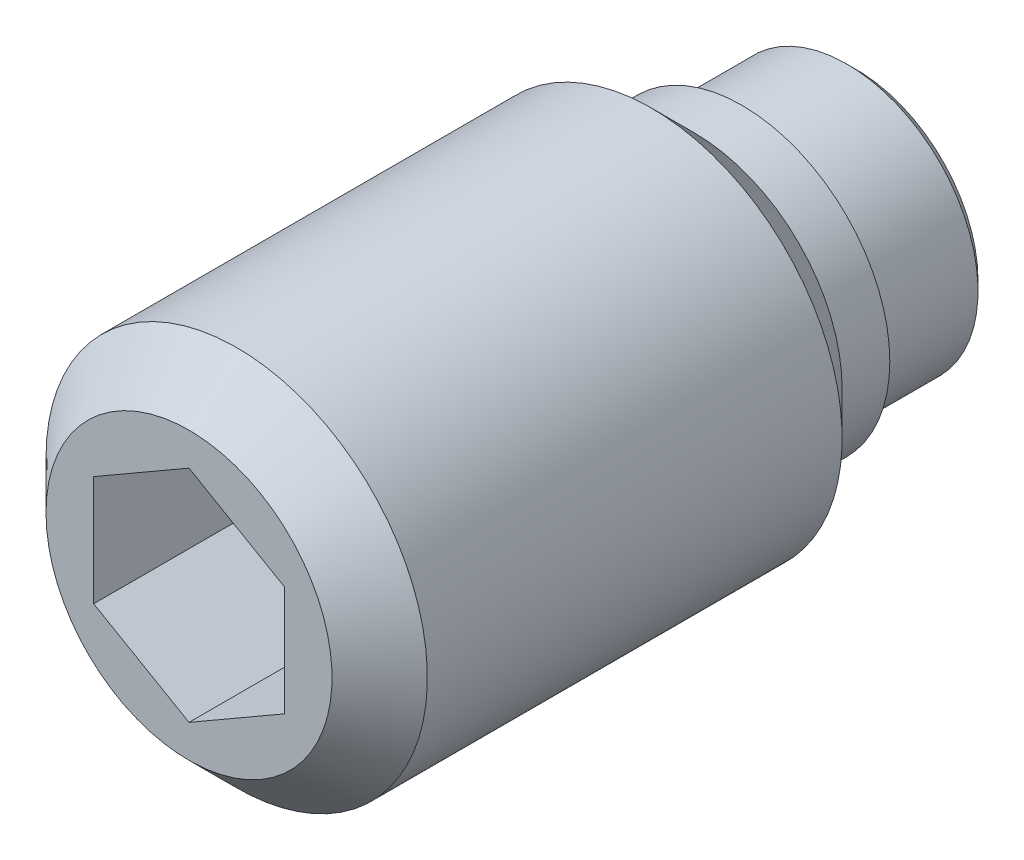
ISO-10303-21;
HEADER;
FILE_DESCRIPTION(('STEP AP214'),'2;1');
FILE_NAME('part.step','',(''),(''),'','','');
FILE_SCHEMA(('AUTOMOTIVE_DESIGN { 1 0 10303 214 1 1 1 1 }'));
ENDSEC;
DATA;
#1=APPLICATION_CONTEXT('core data for automotive mechanical design processes');
#2=APPLICATION_PROTOCOL_DEFINITION('international standard','automotive_design',2000,#1);
#3=PRODUCT_CONTEXT('',#1,'mechanical');
#4=PRODUCT('Part','Part','',(#3));
#5=PRODUCT_RELATED_PRODUCT_CATEGORY('part','',(#4));
#6=PRODUCT_DEFINITION_FORMATION('','',#4);
#7=PRODUCT_DEFINITION_CONTEXT('part definition',#1,'design');
#8=PRODUCT_DEFINITION('design','',#6,#7);
#9=PRODUCT_DEFINITION_SHAPE('','',#8);
#10=(LENGTH_UNIT() NAMED_UNIT(*) SI_UNIT(.MILLI.,.METRE.));
#11=(NAMED_UNIT(*) PLANE_ANGLE_UNIT() SI_UNIT($,.RADIAN.));
#12=(NAMED_UNIT(*) SI_UNIT($,.STERADIAN.) SOLID_ANGLE_UNIT());
#13=UNCERTAINTY_MEASURE_WITH_UNIT(LENGTH_MEASURE(1.E-05),#10,'distance_accuracy_value','');
#14=(GEOMETRIC_REPRESENTATION_CONTEXT(3) GLOBAL_UNCERTAINTY_ASSIGNED_CONTEXT((#13)) GLOBAL_UNIT_ASSIGNED_CONTEXT((#10,
#11,#12)) REPRESENTATION_CONTEXT('',''));
#15=CARTESIAN_POINT('',(0.,0.,0.));
#16=DIRECTION('',(0.,0.,1.));
#17=DIRECTION('',(1.,0.,0.));
#18=AXIS2_PLACEMENT_3D('',#15,#16,#17);
#19=CARTESIAN_POINT('',(0.,3.1,2.4));
#20=DIRECTION('',(0.,0.,1.));
#21=DIRECTION('',(1.,0.,0.));
#22=AXIS2_PLACEMENT_3D('',#19,#20,#21);
#23=PLANE('',#22);
#24=CARTESIAN_POINT('',(0.,0.,2.4));
#25=DIRECTION('',(0.,0.,-1.));
#26=DIRECTION('',(-1.,0.,0.));
#27=AXIS2_PLACEMENT_3D('',#24,#25,#26);
#28=CIRCLE('',#27,2.75);
#29=CARTESIAN_POINT('',(-2.75,0.,2.4));
#30=VERTEX_POINT('',#29);
#31=EDGE_CURVE('E103',#30,#30,#28,.T.);
#32=ORIENTED_EDGE('',*,*,#31,.F.);
#33=EDGE_LOOP('',(#32));
#34=FACE_BOUND('',#33,.T.);
#35=CARTESIAN_POINT('',(0.,0.,2.4));
#36=DIRECTION('',(0.,0.,-1.));
#37=DIRECTION('',(-1.,0.,0.));
#38=AXIS2_PLACEMENT_3D('',#35,#36,#37);
#39=CIRCLE('',#38,3.1);
#40=CARTESIAN_POINT('',(-3.1,0.,2.4));
#41=VERTEX_POINT('',#40);
#42=EDGE_CURVE('E123',#41,#41,#39,.T.);
#43=ORIENTED_EDGE('',*,*,#42,.T.);
#44=EDGE_LOOP('',(#43));
#45=FACE_BOUND('',#44,.T.);
#46=ADVANCED_FACE('F14',(#34,#45),#23,.F.);
#47=CARTESIAN_POINT('',(0.,0.,14.));
#48=DIRECTION('',(0.,0.,-1.));
#49=DIRECTION('',(-1.,0.,0.));
#50=AXIS2_PLACEMENT_3D('',#47,#48,#49);
#51=PLANE('',#50);
#52=CARTESIAN_POINT('',(0.,0.,14.));
#53=DIRECTION('',(0.,0.,-1.));
#54=DIRECTION('',(-1.,0.,0.));
#55=AXIS2_PLACEMENT_3D('',#52,#53,#54);
#56=CIRCLE('',#55,3.);
#57=CARTESIAN_POINT('',(-3.,0.,14.));
#58=VERTEX_POINT('',#57);
#59=EDGE_CURVE('E9',#58,#58,#56,.T.);
#60=ORIENTED_EDGE('',*,*,#59,.F.);
#61=EDGE_LOOP('',(#60));
#62=FACE_BOUND('',#61,.T.);
#63=DIRECTION('',(0.866025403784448,-0.499999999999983,0.));
#64=VECTOR('',#63,1.);
#65=CARTESIAN_POINT('',(0.,2.3094010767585,14.));
#66=LINE('',#65,#64);
#67=CARTESIAN_POINT('',(0.,2.3094010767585,14.));
#68=VERTEX_POINT('',#67);
#69=CARTESIAN_POINT('',(2.,1.1547005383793,14.));
#70=VERTEX_POINT('',#69);
#71=EDGE_CURVE('E29',#68,#70,#66,.T.);
#72=ORIENTED_EDGE('',*,*,#71,.T.);
#73=DIRECTION('',(0.,-1.,0.));
#74=VECTOR('',#73,1.);
#75=CARTESIAN_POINT('',(2.,1.1547005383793,14.));
#76=LINE('',#75,#74);
#77=CARTESIAN_POINT('',(2.,-1.1547005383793,14.));
#78=VERTEX_POINT('',#77);
#79=EDGE_CURVE('E102',#70,#78,#76,.T.);
#80=ORIENTED_EDGE('',*,*,#79,.T.);
#81=DIRECTION('',(-0.866025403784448,-0.499999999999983,0.));
#82=VECTOR('',#81,1.);
#83=CARTESIAN_POINT('',(2.,-1.1547005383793,14.));
#84=LINE('',#83,#82);
#85=CARTESIAN_POINT('',(0.,-2.3094010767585,14.));
#86=VERTEX_POINT('',#85);
#87=EDGE_CURVE('E106',#78,#86,#84,.T.);
#88=ORIENTED_EDGE('',*,*,#87,.T.);
#89=DIRECTION('',(-0.866025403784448,0.499999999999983,0.));
#90=VECTOR('',#89,1.);
#91=CARTESIAN_POINT('',(0.,-2.3094010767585,14.));
#92=LINE('',#91,#90);
#93=CARTESIAN_POINT('',(-2.,-1.1547005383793,14.));
#94=VERTEX_POINT('',#93);
#95=EDGE_CURVE('E109',#86,#94,#92,.T.);
#96=ORIENTED_EDGE('',*,*,#95,.T.);
#97=DIRECTION('',(0.,1.,0.));
#98=VECTOR('',#97,1.);
#99=CARTESIAN_POINT('',(-2.,-1.1547005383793,14.));
#100=LINE('',#99,#98);
#101=CARTESIAN_POINT('',(-2.,1.1547005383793,14.));
#102=VERTEX_POINT('',#101);
#103=EDGE_CURVE('E92',#94,#102,#100,.T.);
#104=ORIENTED_EDGE('',*,*,#103,.T.);
#105=DIRECTION('',(0.866025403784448,0.499999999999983,0.));
#106=VECTOR('',#105,1.);
#107=CARTESIAN_POINT('',(-2.,1.1547005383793,14.));
#108=LINE('',#107,#106);
#109=EDGE_CURVE('E112',#102,#68,#108,.T.);
#110=ORIENTED_EDGE('',*,*,#109,.T.);
#111=EDGE_LOOP('',(#72,#80,#88,#96,#104,#110));
#112=FACE_BOUND('',#111,.T.);
#113=ADVANCED_FACE('F16',(#62,#112),#51,.F.);
#114=CARTESIAN_POINT('',(0.,0.,14.));
#115=DIRECTION('',(0.,0.,-1.));
#116=DIRECTION('',(-1.,0.,0.));
#117=AXIS2_PLACEMENT_3D('',#114,#115,#116);
#118=CONICAL_SURFACE('',#117,3.,0.785398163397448);
#119=CARTESIAN_POINT('',(0.,0.,13.));
#120=DIRECTION('',(0.,0.,-1.));
#121=DIRECTION('',(-1.,0.,0.));
#122=AXIS2_PLACEMENT_3D('',#119,#120,#121);
#123=CIRCLE('',#122,4.);
#124=CARTESIAN_POINT('',(-4.,0.,13.));
#125=VERTEX_POINT('',#124);
#126=EDGE_CURVE('E22',#125,#125,#123,.T.);
#127=ORIENTED_EDGE('',*,*,#126,.F.);
#128=EDGE_LOOP('',(#127));
#129=FACE_BOUND('',#128,.T.);
#130=ORIENTED_EDGE('',*,*,#59,.T.);
#131=EDGE_LOOP('',(#130));
#132=FACE_BOUND('',#131,.T.);
#133=ADVANCED_FACE('F136',(#129,#132),#118,.T.);
#134=CARTESIAN_POINT('',(0.,0.,2.4));
#135=DIRECTION('',(0.,0.,-1.));
#136=DIRECTION('',(-1.,0.,0.));
#137=AXIS2_PLACEMENT_3D('',#134,#135,#136);
#138=CYLINDRICAL_SURFACE('',#137,4.);
#139=CARTESIAN_POINT('',(0.,0.,4.3));
#140=DIRECTION('',(0.,0.,-1.));
#141=DIRECTION('',(-1.,0.,0.));
#142=AXIS2_PLACEMENT_3D('',#139,#140,#141);
#143=CIRCLE('',#142,4.);
#144=CARTESIAN_POINT('',(-4.,0.,4.3));
#145=VERTEX_POINT('',#144);
#146=EDGE_CURVE('E129',#145,#145,#143,.T.);
#147=ORIENTED_EDGE('',*,*,#146,.F.);
#148=EDGE_LOOP('',(#147));
#149=FACE_BOUND('',#148,.T.);
#150=ORIENTED_EDGE('',*,*,#126,.T.);
#151=EDGE_LOOP('',(#150));
#152=FACE_BOUND('',#151,.T.);
#153=ADVANCED_FACE('F134',(#149,#152),#138,.T.);
#154=CARTESIAN_POINT('',(0.,0.,4.3));
#155=DIRECTION('',(0.,0.,1.));
#156=DIRECTION('',(1.,0.,0.));
#157=AXIS2_PLACEMENT_3D('',#154,#155,#156);
#158=CONICAL_SURFACE('',#157,4.,0.785398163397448);
#159=CARTESIAN_POINT('',(0.,0.,3.4));
#160=DIRECTION('',(0.,0.,-1.));
#161=DIRECTION('',(-1.,0.,0.));
#162=AXIS2_PLACEMENT_3D('',#159,#160,#161);
#163=CIRCLE('',#162,3.1);
#164=CARTESIAN_POINT('',(-3.1,0.,3.4));
#165=VERTEX_POINT('',#164);
#166=EDGE_CURVE('E126',#165,#165,#163,.T.);
#167=ORIENTED_EDGE('',*,*,#166,.F.);
#168=EDGE_LOOP('',(#167));
#169=FACE_BOUND('',#168,.T.);
#170=ORIENTED_EDGE('',*,*,#146,.T.);
#171=EDGE_LOOP('',(#170));
#172=FACE_BOUND('',#171,.T.);
#173=ADVANCED_FACE('F178',(#169,#172),#158,.T.);
#174=CARTESIAN_POINT('',(0.,0.,2.4));
#175=DIRECTION('',(0.,0.,-1.));
#176=DIRECTION('',(-1.,0.,0.));
#177=AXIS2_PLACEMENT_3D('',#174,#175,#176);
#178=CYLINDRICAL_SURFACE('',#177,3.1);
#179=ORIENTED_EDGE('',*,*,#42,.F.);
#180=EDGE_LOOP('',(#179));
#181=FACE_BOUND('',#180,.T.);
#182=ORIENTED_EDGE('',*,*,#166,.T.);
#183=EDGE_LOOP('',(#182));
#184=FACE_BOUND('',#183,.T.);
#185=ADVANCED_FACE('F165',(#181,#184),#178,.T.);
#186=CARTESIAN_POINT('',(0.,2.3094010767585,10.));
#187=DIRECTION('',(-0.499999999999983,-0.866025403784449,0.));
#188=DIRECTION('',(-0.866025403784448,0.499999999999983,0.));
#189=AXIS2_PLACEMENT_3D('',#186,#187,#188);
#190=PLANE('',#189);
#191=ORIENTED_EDGE('',*,*,#71,.F.);
#192=DIRECTION('',(0.,0.,1.));
#193=VECTOR('',#192,1.);
#194=CARTESIAN_POINT('',(0.,2.3094010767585,10.));
#195=LINE('',#194,#193);
#196=CARTESIAN_POINT('',(0.,2.3094010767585,10.));
#197=VERTEX_POINT('',#196);
#198=EDGE_CURVE('E97',#197,#68,#195,.T.);
#199=ORIENTED_EDGE('',*,*,#198,.F.);
#200=DIRECTION('',(0.866025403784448,-0.499999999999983,0.));
#201=VECTOR('',#200,1.);
#202=CARTESIAN_POINT('',(0.,2.3094010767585,10.));
#203=LINE('',#202,#201);
#204=CARTESIAN_POINT('',(2.,1.1547005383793,10.));
#205=VERTEX_POINT('',#204);
#206=EDGE_CURVE('E115',#197,#205,#203,.T.);
#207=ORIENTED_EDGE('',*,*,#206,.T.);
#208=DIRECTION('',(0.,0.,1.));
#209=VECTOR('',#208,1.);
#210=CARTESIAN_POINT('',(2.,1.1547005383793,10.));
#211=LINE('',#210,#209);
#212=EDGE_CURVE('E121',#205,#70,#211,.T.);
#213=ORIENTED_EDGE('',*,*,#212,.T.);
#214=EDGE_LOOP('',(#191,#199,#207,#213));
#215=FACE_BOUND('',#214,.T.);
#216=ADVANCED_FACE('F144',(#215),#190,.T.);
#217=CARTESIAN_POINT('',(2.,1.1547005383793,10.));
#218=DIRECTION('',(-1.,0.,0.));
#219=DIRECTION('',(0.,0.,1.));
#220=AXIS2_PLACEMENT_3D('',#217,#218,#219);
#221=PLANE('',#220);
#222=ORIENTED_EDGE('',*,*,#79,.F.);
#223=ORIENTED_EDGE('',*,*,#212,.F.);
#224=DIRECTION('',(0.,-1.,0.));
#225=VECTOR('',#224,1.);
#226=CARTESIAN_POINT('',(2.,1.1547005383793,10.));
#227=LINE('',#226,#225);
#228=CARTESIAN_POINT('',(2.,-1.1547005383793,10.));
#229=VERTEX_POINT('',#228);
#230=EDGE_CURVE('E69',#205,#229,#227,.T.);
#231=ORIENTED_EDGE('',*,*,#230,.T.);
#232=DIRECTION('',(0.,0.,1.));
#233=VECTOR('',#232,1.);
#234=CARTESIAN_POINT('',(2.,-1.1547005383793,10.));
#235=LINE('',#234,#233);
#236=EDGE_CURVE('E119',#229,#78,#235,.T.);
#237=ORIENTED_EDGE('',*,*,#236,.T.);
#238=EDGE_LOOP('',(#222,#223,#231,#237));
#239=FACE_BOUND('',#238,.T.);
#240=ADVANCED_FACE('F155',(#239),#221,.T.);
#241=CARTESIAN_POINT('',(2.,-1.1547005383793,10.));
#242=DIRECTION('',(-0.499999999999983,0.866025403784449,0.));
#243=DIRECTION('',(0.866025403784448,0.499999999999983,0.));
#244=AXIS2_PLACEMENT_3D('',#241,#242,#243);
#245=PLANE('',#244);
#246=ORIENTED_EDGE('',*,*,#87,.F.);
#247=ORIENTED_EDGE('',*,*,#236,.F.);
#248=DIRECTION('',(-0.866025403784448,-0.499999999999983,0.));
#249=VECTOR('',#248,1.);
#250=CARTESIAN_POINT('',(2.,-1.1547005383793,10.));
#251=LINE('',#250,#249);
#252=CARTESIAN_POINT('',(0.,-2.3094010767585,10.));
#253=VERTEX_POINT('',#252);
#254=EDGE_CURVE('E88',#229,#253,#251,.T.);
#255=ORIENTED_EDGE('',*,*,#254,.T.);
#256=DIRECTION('',(0.,0.,1.));
#257=VECTOR('',#256,1.);
#258=CARTESIAN_POINT('',(0.,-2.3094010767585,10.));
#259=LINE('',#258,#257);
#260=EDGE_CURVE('E85',#253,#86,#259,.T.);
#261=ORIENTED_EDGE('',*,*,#260,.T.);
#262=EDGE_LOOP('',(#246,#247,#255,#261));
#263=FACE_BOUND('',#262,.T.);
#264=ADVANCED_FACE('F153',(#263),#245,.T.);
#265=CARTESIAN_POINT('',(0.,-2.3094010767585,10.));
#266=DIRECTION('',(0.499999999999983,0.866025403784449,0.));
#267=DIRECTION('',(0.866025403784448,-0.499999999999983,0.));
#268=AXIS2_PLACEMENT_3D('',#265,#266,#267);
#269=PLANE('',#268);
#270=ORIENTED_EDGE('',*,*,#95,.F.);
#271=ORIENTED_EDGE('',*,*,#260,.F.);
#272=DIRECTION('',(-0.866025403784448,0.499999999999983,0.));
#273=VECTOR('',#272,1.);
#274=CARTESIAN_POINT('',(0.,-2.3094010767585,10.));
#275=LINE('',#274,#273);
#276=CARTESIAN_POINT('',(-2.,-1.1547005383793,10.));
#277=VERTEX_POINT('',#276);
#278=EDGE_CURVE('E80',#253,#277,#275,.T.);
#279=ORIENTED_EDGE('',*,*,#278,.T.);
#280=DIRECTION('',(0.,0.,1.));
#281=VECTOR('',#280,1.);
#282=CARTESIAN_POINT('',(-2.,-1.1547005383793,10.));
#283=LINE('',#282,#281);
#284=EDGE_CURVE('E84',#277,#94,#283,.T.);
#285=ORIENTED_EDGE('',*,*,#284,.T.);
#286=EDGE_LOOP('',(#270,#271,#279,#285));
#287=FACE_BOUND('',#286,.T.);
#288=ADVANCED_FACE('F83',(#287),#269,.T.);
#289=CARTESIAN_POINT('',(-2.,-1.1547005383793,10.));
#290=DIRECTION('',(1.,0.,0.));
#291=DIRECTION('',(0.,0.,-1.));
#292=AXIS2_PLACEMENT_3D('',#289,#290,#291);
#293=PLANE('',#292);
#294=ORIENTED_EDGE('',*,*,#103,.F.);
#295=ORIENTED_EDGE('',*,*,#284,.F.);
#296=DIRECTION('',(0.,1.,0.));
#297=VECTOR('',#296,1.);
#298=CARTESIAN_POINT('',(-2.,-1.1547005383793,10.));
#299=LINE('',#298,#297);
#300=CARTESIAN_POINT('',(-2.,1.1547005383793,10.));
#301=VERTEX_POINT('',#300);
#302=EDGE_CURVE('E87',#277,#301,#299,.T.);
#303=ORIENTED_EDGE('',*,*,#302,.T.);
#304=DIRECTION('',(0.,0.,1.));
#305=VECTOR('',#304,1.);
#306=CARTESIAN_POINT('',(-2.,1.1547005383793,10.));
#307=LINE('',#306,#305);
#308=EDGE_CURVE('E60',#301,#102,#307,.T.);
#309=ORIENTED_EDGE('',*,*,#308,.T.);
#310=EDGE_LOOP('',(#294,#295,#303,#309));
#311=FACE_BOUND('',#310,.T.);
#312=ADVANCED_FACE('F90',(#311),#293,.T.);
#313=CARTESIAN_POINT('',(-2.,1.1547005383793,10.));
#314=DIRECTION('',(0.499999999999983,-0.866025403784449,0.));
#315=DIRECTION('',(-0.866025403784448,-0.499999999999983,0.));
#316=AXIS2_PLACEMENT_3D('',#313,#314,#315);
#317=PLANE('',#316);
#318=ORIENTED_EDGE('',*,*,#109,.F.);
#319=ORIENTED_EDGE('',*,*,#308,.F.);
#320=DIRECTION('',(0.866025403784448,0.499999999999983,0.));
#321=VECTOR('',#320,1.);
#322=CARTESIAN_POINT('',(-2.,1.1547005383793,10.));
#323=LINE('',#322,#321);
#324=EDGE_CURVE('E37',#301,#197,#323,.T.);
#325=ORIENTED_EDGE('',*,*,#324,.T.);
#326=ORIENTED_EDGE('',*,*,#198,.T.);
#327=EDGE_LOOP('',(#318,#319,#325,#326));
#328=FACE_BOUND('',#327,.T.);
#329=ADVANCED_FACE('F143',(#328),#317,.T.);
#330=CARTESIAN_POINT('',(0.,0.,10.));
#331=DIRECTION('',(0.,0.,-1.));
#332=DIRECTION('',(-1.,0.,0.));
#333=AXIS2_PLACEMENT_3D('',#330,#331,#332);
#334=PLANE('',#333);
#335=ORIENTED_EDGE('',*,*,#206,.F.);
#336=ORIENTED_EDGE('',*,*,#324,.F.);
#337=ORIENTED_EDGE('',*,*,#302,.F.);
#338=ORIENTED_EDGE('',*,*,#278,.F.);
#339=ORIENTED_EDGE('',*,*,#254,.F.);
#340=ORIENTED_EDGE('',*,*,#230,.F.);
#341=EDGE_LOOP('',(#335,#336,#337,#338,#339,#340));
#342=FACE_BOUND('',#341,.T.);
#343=ADVANCED_FACE('F95',(#342),#334,.F.);
#344=CARTESIAN_POINT('',(0.,0.,-1.));
#345=DIRECTION('',(0.,0.,-1.));
#346=DIRECTION('',(-1.,0.,0.));
#347=AXIS2_PLACEMENT_3D('',#344,#345,#346);
#348=CYLINDRICAL_SURFACE('',#347,2.75);
#349=CARTESIAN_POINT('',(0.,0.,0.2));
#350=DIRECTION('',(0.,0.,-1.));
#351=DIRECTION('',(-1.,0.,0.));
#352=AXIS2_PLACEMENT_3D('',#349,#350,#351);
#353=CIRCLE('',#352,2.75);
#354=CARTESIAN_POINT('',(-2.75,0.,0.2));
#355=VERTEX_POINT('',#354);
#356=EDGE_CURVE('E322',#355,#355,#353,.T.);
#357=ORIENTED_EDGE('',*,*,#356,.F.);
#358=EDGE_LOOP('',(#357));
#359=FACE_BOUND('',#358,.T.);
#360=ORIENTED_EDGE('',*,*,#31,.T.);
#361=EDGE_LOOP('',(#360));
#362=FACE_BOUND('',#361,.T.);
#363=ADVANCED_FACE('F263',(#359,#362),#348,.T.);
#364=CARTESIAN_POINT('',(0.,0.,0.2));
#365=DIRECTION('',(0.,0.,1.));
#366=DIRECTION('',(1.,0.,0.));
#367=AXIS2_PLACEMENT_3D('',#364,#365,#366);
#368=CONICAL_SURFACE('',#367,2.75,0.785398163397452);
#369=CARTESIAN_POINT('',(0.,0.,0.));
#370=DIRECTION('',(0.,0.,-1.));
#371=DIRECTION('',(-1.,0.,0.));
#372=AXIS2_PLACEMENT_3D('',#369,#370,#371);
#373=CIRCLE('',#372,2.55);
#374=CARTESIAN_POINT('',(-2.55,0.,0.));
#375=VERTEX_POINT('',#374);
#376=EDGE_CURVE('E319',#375,#375,#373,.T.);
#377=ORIENTED_EDGE('',*,*,#376,.F.);
#378=EDGE_LOOP('',(#377));
#379=FACE_BOUND('',#378,.T.);
#380=ORIENTED_EDGE('',*,*,#356,.T.);
#381=EDGE_LOOP('',(#380));
#382=FACE_BOUND('',#381,.T.);
#383=ADVANCED_FACE('F270',(#379,#382),#368,.T.);
#384=CARTESIAN_POINT('',(0.,2.55,0.));
#385=DIRECTION('',(0.,0.,1.));
#386=DIRECTION('',(1.,0.,0.));
#387=AXIS2_PLACEMENT_3D('',#384,#385,#386);
#388=PLANE('',#387);
#389=CARTESIAN_POINT('',(0.,0.,0.));
#390=DIRECTION('',(0.,0.,-1.));
#391=DIRECTION('',(-1.,0.,0.));
#392=AXIS2_PLACEMENT_3D('',#389,#390,#391);
#393=CIRCLE('',#392,1.);
#394=CARTESIAN_POINT('',(-1.,0.,0.));
#395=VERTEX_POINT('',#394);
#396=EDGE_CURVE('E318',#395,#395,#393,.T.);
#397=ORIENTED_EDGE('',*,*,#396,.F.);
#398=EDGE_LOOP('',(#397));
#399=FACE_BOUND('',#398,.T.);
#400=ORIENTED_EDGE('',*,*,#376,.T.);
#401=EDGE_LOOP('',(#400));
#402=FACE_BOUND('',#401,.T.);
#403=ADVANCED_FACE('F278',(#399,#402),#388,.F.);
#404=CARTESIAN_POINT('',(0.,0.,0.));
#405=DIRECTION('',(0.,0.,1.));
#406=DIRECTION('',(1.,0.,0.));
#407=AXIS2_PLACEMENT_3D('',#404,#405,#406);
#408=CONICAL_SURFACE('',#407,1.,0.785398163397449);
#409=CARTESIAN_POINT('',(0.,0.,-1.));
#410=VERTEX_POINT('',#409);
#411=VERTEX_LOOP('',#410);
#412=FACE_BOUND('',#411,.T.);
#413=ORIENTED_EDGE('',*,*,#396,.T.);
#414=EDGE_LOOP('',(#413));
#415=FACE_BOUND('',#414,.T.);
#416=ADVANCED_FACE('F286',(#412,#415),#408,.T.);
#417=CLOSED_SHELL('',(#46,#113,#133,#153,#173,#185,#216,#240,#264,#288,#312,#329,#343,#363,#383,
#403,#416));
#418=MANIFOLD_SOLID_BREP('B1',#417);
#419=ADVANCED_BREP_SHAPE_REPRESENTATION('',(#18,#418),#14);
#420=SHAPE_DEFINITION_REPRESENTATION(#9,#419);
ENDSEC;
END-ISO-10303-21;
